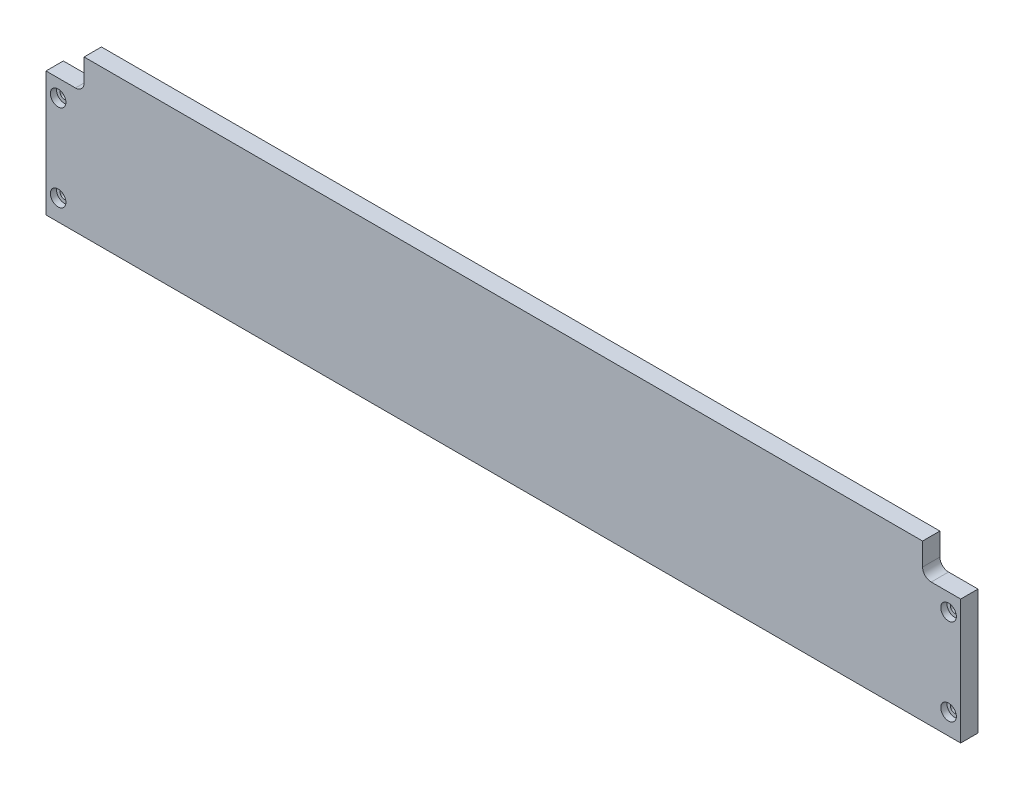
from build123d import *

# Parameters (mm, degrees)
BOSS_EXTRUDE1_DEPTH     = 6.35
SKETCH2_R               = 5.715
CUT_EXTRUDE1_DEPTH      = 4.572
SKETCH3_R               = 3.175
CUT_EXTRUDE2_DEPTH      = 11.43
LPATTERN1_COUNT         = 2
LPATTERN1_PITCH         = 63.5
MIRROR1_COPY_1_SKETCH_R = 5.715
MIRROR1_COPY_1_DEPTH    = 4.572
MIRROR1_COPY_2_SKETCH_R = 3.175
MIRROR1_COPY_2_DEPTH    = 11.43


with BuildPart() as part:
    # Sketch1 → Boss-Extrude1 (new, symmetric)
    with BuildSketch(Plane.XY):
        with BuildLine():
            Line((335.28, 0), (-335.28, 0))
            Line((-335.28, 0), (-335.28, 91.44))
            Line((-335.28, 91.44), (-313.69, 91.44))
            ThreePointArc((-313.69, 91.44), (-309.199871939, 93.299871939), (-307.34, 97.79))
            Line((-307.34, 97.79), (-307.34, 114.3))
            Line((-307.34, 114.3), (307.34, 114.3))
            Line((307.34, 114.3), (307.34, 97.79))
            ThreePointArc((307.34, 97.79), (309.199871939, 93.299871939), (313.69, 91.44))
            Line((313.69, 91.44), (335.28, 91.44))
            Line((335.28, 91.44), (335.28, 0))
        make_face()
    extrude(amount=BOSS_EXTRUDE1_DEPTH, both=True)

    # Sketch2 → Cut-Extrude1 (cut)
    with BuildSketch(Plane.XY.offset(6.35)):
        with Locations((326.39, 78.74)):
            Circle(SKETCH2_R)
    cut_extrude1 = extrude(amount=-CUT_EXTRUDE1_DEPTH, mode=Mode.SUBTRACT)

    # Sketch3 → Cut-Extrude2 (cut)
    with BuildSketch(Plane.XY.offset(1.778)):
        with Locations((326.39, 78.74)):
            Circle(SKETCH3_R)
    cut_extrude2 = extrude(amount=-CUT_EXTRUDE2_DEPTH, mode=Mode.SUBTRACT)

    # LPattern1: Cut-Extrude1, Cut-Extrude2 ×2
    with Locations(*[(0, -i * LPATTERN1_PITCH, 0) for i in range(1, LPATTERN1_COUNT)]):
        add(cut_extrude1, mode=Mode.SUBTRACT)
        add(cut_extrude2, mode=Mode.SUBTRACT)

    # Mirror1: Cut-Extrude1, Cut-Extrude2 across plane
    add(cut_extrude1.mirror(Plane(origin=(0, 0, 0), x_dir=(0, 0, 1), z_dir=(1, 0, 0))), mode=Mode.SUBTRACT)
    add(cut_extrude2.mirror(Plane(origin=(0, 0, 0), x_dir=(0, 0, 1), z_dir=(1, 0, 0))), mode=Mode.SUBTRACT)

    # Mirror1 copy 1 sketch → Mirror1 copy 1 (cut)
    with BuildSketch(Plane(origin=(0, -63.5, 6.35), x_dir=(-1, 0, 0), z_dir=(0, 0, 1))):
        with Locations((326.39, -78.74)):
            Circle(MIRROR1_COPY_1_SKETCH_R)
    extrude(amount=-MIRROR1_COPY_1_DEPTH, mode=Mode.SUBTRACT)

    # Mirror1 copy 2 sketch → Mirror1 copy 2 (cut)
    with BuildSketch(Plane(origin=(0, -63.5, 1.778), x_dir=(-1, 0, 0), z_dir=(0, 0, 1))):
        with Locations((326.39, -78.74)):
            Circle(MIRROR1_COPY_2_SKETCH_R)
    extrude(amount=-MIRROR1_COPY_2_DEPTH, mode=Mode.SUBTRACT)


solid = part.part
